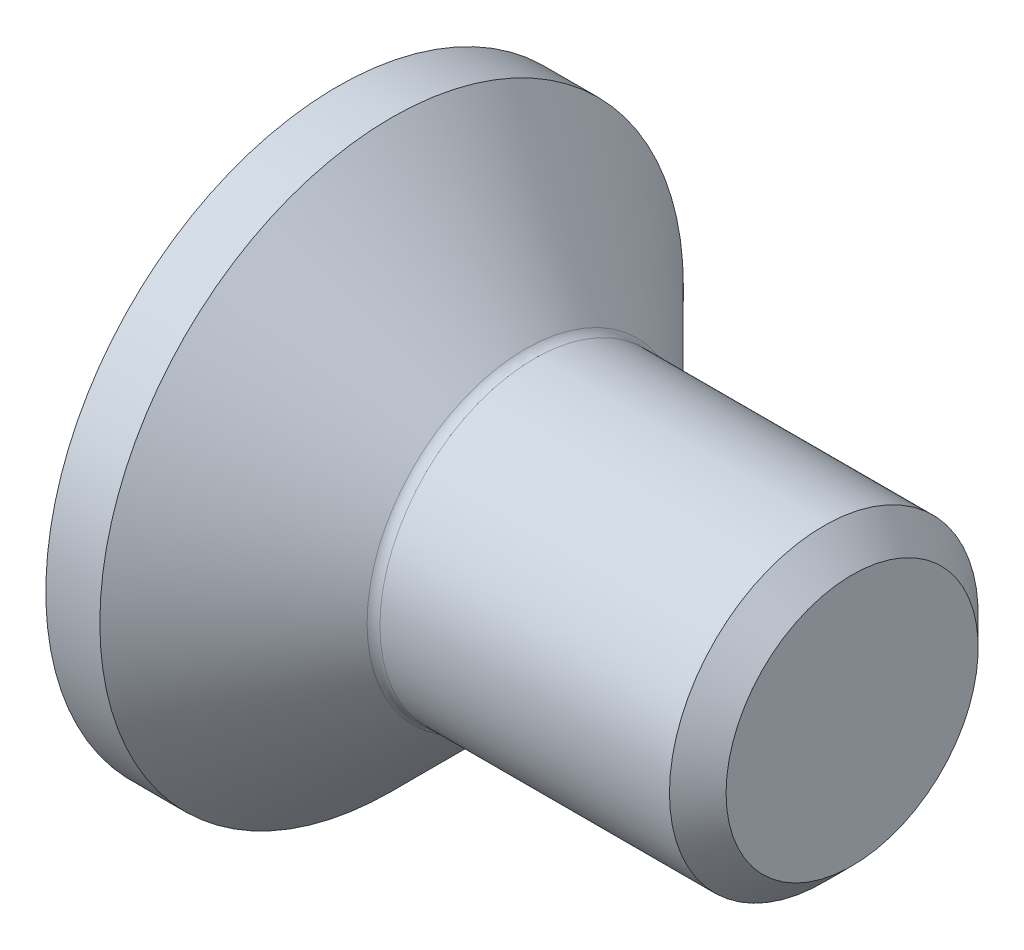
from build123d import *

# Parameters (mm, degrees)
HEXAGONSOCKET_DEPTH = 1.1
HEADFILLET_R        = 0.25
CHAMFER_2_SIZE      = 0.55
SKETCH4_W           = 5
SKETCH4_H           = 5


with BuildPart() as part:
    # Sketch1 → Base (revolve)
    with BuildSketch(Plane.XY, mode=Mode.PRIVATE) as base_sk:
        Polygon((0, 0), (0, 6.72), (3.72, 3), (10, 3), (10, 0), align=None)
    revolve(base_sk.sketch.rotate(Axis((-0.587069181, 0, 0), (1, 0, 0)), 90), axis=Axis((-0.587069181, 0, 0), (1, 0, 0)))

    # Sketch2 → HexagonSocket (cut)
    with BuildSketch(Plane(origin=(0, 0, 0), x_dir=(0, 0, -1), z_dir=(1, 0, 0))):
        Polygon((2.309401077, 0), (1.154700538, 2), (-1.154700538, 2), (-2.309401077, 0), (-1.154700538, -2), (1.154700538, -2), align=None)
    extrude(amount=HEXAGONSOCKET_DEPTH, mode=Mode.SUBTRACT)

    # Sketch3 → Cut-Revolve1 (revolve, cut)
    with BuildSketch(Plane.XY, mode=Mode.PRIVATE) as cut_revolve1_sk:
        Polygon((1.1, 2), (2.254700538, 0), (1.1, 0), align=None)
    revolve(cut_revolve1_sk.sketch.rotate(Axis((-0.439109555, 0, 0), (1, 0, 0)), 90), axis=Axis((-0.439109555, 0, 0), (1, 0, 0)), mode=Mode.SUBTRACT)

    # HeadFillet
    headfillet_edges = [part.edges().sort_by_distance(p)[0] for p in [
        (3.72, 0, -3),
    ]]
    fillet(headfillet_edges, radius=HEADFILLET_R)

    # Chamfer 2
    chamfer_2_edges = [part.edges().sort_by_distance(p)[0] for p in [
        (10, 0, -3),
    ]]
    chamfer(chamfer_2_edges, length=CHAMFER_2_SIZE)

    # Sketch4 → Cut-Revolve2 (revolve, cut)
    with BuildSketch(Plane(origin=(0, 0, 0), x_dir=(1, 0, 0), z_dir=(0, 1, 0)), mode=Mode.PRIVATE) as cut_revolve2_sk:
        with Locations((0.5, 8.17)):
            Rectangle(SKETCH4_W, SKETCH4_H)
    revolve(cut_revolve2_sk.sketch.rotate(Axis((11.853138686, 0, 0), (-1, 0, 0)), 180), axis=Axis((11.853138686, 0, 0), (-1, 0, 0)), mode=Mode.SUBTRACT)


solid = part.part
